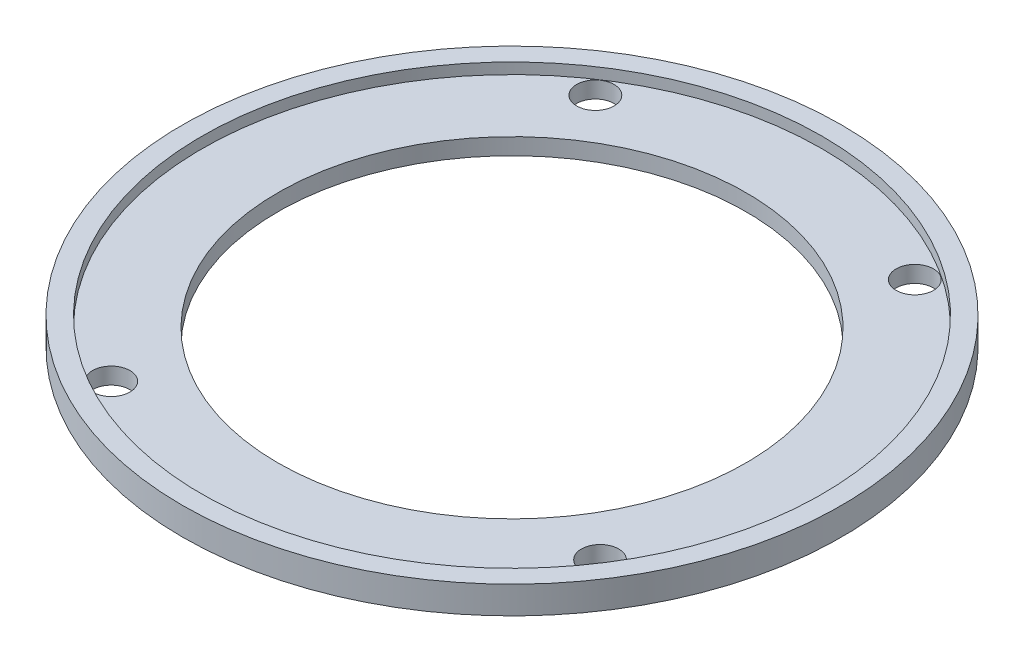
ISO-10303-21;
HEADER;
FILE_DESCRIPTION(('STEP AP214'),'2;1');
FILE_NAME('part.step','',(''),(''),'','','');
FILE_SCHEMA(('AUTOMOTIVE_DESIGN { 1 0 10303 214 1 1 1 1 }'));
ENDSEC;
DATA;
#1=APPLICATION_CONTEXT('core data for automotive mechanical design processes');
#2=APPLICATION_PROTOCOL_DEFINITION('international standard','automotive_design',2000,#1);
#3=PRODUCT_CONTEXT('',#1,'mechanical');
#4=PRODUCT('Part','Part','',(#3));
#5=PRODUCT_RELATED_PRODUCT_CATEGORY('part','',(#4));
#6=PRODUCT_DEFINITION_FORMATION('','',#4);
#7=PRODUCT_DEFINITION_CONTEXT('part definition',#1,'design');
#8=PRODUCT_DEFINITION('design','',#6,#7);
#9=PRODUCT_DEFINITION_SHAPE('','',#8);
#10=(LENGTH_UNIT() NAMED_UNIT(*) SI_UNIT(.MILLI.,.METRE.));
#11=(NAMED_UNIT(*) PLANE_ANGLE_UNIT() SI_UNIT($,.RADIAN.));
#12=(NAMED_UNIT(*) SI_UNIT($,.STERADIAN.) SOLID_ANGLE_UNIT());
#13=UNCERTAINTY_MEASURE_WITH_UNIT(LENGTH_MEASURE(1.E-05),#10,'distance_accuracy_value','');
#14=(GEOMETRIC_REPRESENTATION_CONTEXT(3) GLOBAL_UNCERTAINTY_ASSIGNED_CONTEXT((#13)) GLOBAL_UNIT_ASSIGNED_CONTEXT((#10,
#11,#12)) REPRESENTATION_CONTEXT('',''));
#15=CARTESIAN_POINT('',(0.,0.,0.));
#16=DIRECTION('',(0.,0.,1.));
#17=DIRECTION('',(1.,0.,0.));
#18=AXIS2_PLACEMENT_3D('',#15,#16,#17);
#19=CARTESIAN_POINT('',(0.,0.,0.));
#20=DIRECTION('',(0.,1.,0.));
#21=DIRECTION('',(0.,0.,1.));
#22=AXIS2_PLACEMENT_3D('',#19,#20,#21);
#23=PLANE('',#22);
#24=CARTESIAN_POINT('',(-15.2019,0.,-23.1390758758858));
#25=DIRECTION('',(0.,1.,0.));
#26=DIRECTION('',(0.,0.,1.));
#27=AXIS2_PLACEMENT_3D('',#24,#25,#26);
#28=CIRCLE('',#27,1.778);
#29=CARTESIAN_POINT('',(-15.2019,0.,-21.3610758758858));
#30=VERTEX_POINT('',#29);
#31=EDGE_CURVE('E70',#30,#30,#28,.T.);
#32=ORIENTED_EDGE('',*,*,#31,.T.);
#33=EDGE_LOOP('',(#32));
#34=FACE_BOUND('',#33,.T.);
#35=CARTESIAN_POINT('',(15.2019,0.,-23.1390758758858));
#36=DIRECTION('',(0.,1.,0.));
#37=DIRECTION('',(0.,0.,1.));
#38=AXIS2_PLACEMENT_3D('',#35,#36,#37);
#39=CIRCLE('',#38,1.778);
#40=CARTESIAN_POINT('',(15.2019,0.,-21.3610758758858));
#41=VERTEX_POINT('',#40);
#42=EDGE_CURVE('E64',#41,#41,#39,.T.);
#43=ORIENTED_EDGE('',*,*,#42,.T.);
#44=EDGE_LOOP('',(#43));
#45=FACE_BOUND('',#44,.T.);
#46=CARTESIAN_POINT('',(23.3143627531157,0.,14.9316805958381));
#47=DIRECTION('',(0.,1.,0.));
#48=DIRECTION('',(0.,0.,1.));
#49=AXIS2_PLACEMENT_3D('',#46,#47,#48);
#50=CIRCLE('',#49,1.778);
#51=CARTESIAN_POINT('',(23.3143627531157,0.,16.7096805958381));
#52=VERTEX_POINT('',#51);
#53=EDGE_CURVE('E58',#52,#52,#50,.T.);
#54=ORIENTED_EDGE('',*,*,#53,.T.);
#55=EDGE_LOOP('',(#54));
#56=FACE_BOUND('',#55,.T.);
#57=CARTESIAN_POINT('',(-14.6594402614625,0.,23.4864941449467));
#58=DIRECTION('',(0.,1.,0.));
#59=DIRECTION('',(0.,0.,1.));
#60=AXIS2_PLACEMENT_3D('',#57,#58,#59);
#61=CIRCLE('',#60,1.778);
#62=CARTESIAN_POINT('',(-14.6594402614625,0.,25.2644941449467));
#63=VERTEX_POINT('',#62);
#64=EDGE_CURVE('E52',#63,#63,#61,.T.);
#65=ORIENTED_EDGE('',*,*,#64,.T.);
#66=EDGE_LOOP('',(#65));
#67=FACE_BOUND('',#66,.T.);
#68=CARTESIAN_POINT('',(0.,0.,0.));
#69=DIRECTION('',(0.,1.,0.));
#70=DIRECTION('',(0.,0.,1.));
#71=AXIS2_PLACEMENT_3D('',#68,#69,#70);
#72=CIRCLE('',#71,22.28215);
#73=CARTESIAN_POINT('',(0.,0.,22.28215));
#74=VERTEX_POINT('',#73);
#75=EDGE_CURVE('E43',#74,#74,#72,.T.);
#76=ORIENTED_EDGE('',*,*,#75,.T.);
#77=EDGE_LOOP('',(#76));
#78=FACE_BOUND('',#77,.T.);
#79=CARTESIAN_POINT('',(0.,0.,0.));
#80=DIRECTION('',(0.,-1.,0.));
#81=DIRECTION('',(0.,0.,-1.));
#82=AXIS2_PLACEMENT_3D('',#79,#80,#81);
#83=CIRCLE('',#82,31.369);
#84=CARTESIAN_POINT('',(0.,0.,-31.369));
#85=VERTEX_POINT('',#84);
#86=EDGE_CURVE('E48',#85,#85,#83,.T.);
#87=ORIENTED_EDGE('',*,*,#86,.T.);
#88=EDGE_LOOP('',(#87));
#89=FACE_BOUND('',#88,.T.);
#90=ADVANCED_FACE('F33',(#34,#45,#56,#67,#78,#89),#23,.F.);
#91=CARTESIAN_POINT('',(0.,1.5748,0.));
#92=DIRECTION('',(0.,1.,0.));
#93=DIRECTION('',(0.,0.,1.));
#94=AXIS2_PLACEMENT_3D('',#91,#92,#93);
#95=PLANE('',#94);
#96=CARTESIAN_POINT('',(0.,1.5748,0.));
#97=DIRECTION('',(0.,1.,0.));
#98=DIRECTION('',(0.,0.,1.));
#99=AXIS2_PLACEMENT_3D('',#96,#97,#98);
#100=CIRCLE('',#99,29.5148);
#101=CARTESIAN_POINT('',(0.,1.57479999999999,-29.5148));
#102=VERTEX_POINT('',#101);
#103=EDGE_CURVE('E11',#102,#102,#100,.F.);
#104=ORIENTED_EDGE('',*,*,#103,.F.);
#105=EDGE_LOOP('',(#104));
#106=FACE_BOUND('',#105,.T.);
#107=CARTESIAN_POINT('',(-15.2019,1.5748,-23.1390758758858));
#108=DIRECTION('',(0.,-1.,0.));
#109=DIRECTION('',(0.,0.,-1.));
#110=AXIS2_PLACEMENT_3D('',#107,#108,#109);
#111=CIRCLE('',#110,1.778);
#112=CARTESIAN_POINT('',(-15.2019,1.5748,-24.9170758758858));
#113=VERTEX_POINT('',#112);
#114=EDGE_CURVE('E73',#113,#113,#111,.T.);
#115=ORIENTED_EDGE('',*,*,#114,.T.);
#116=EDGE_LOOP('',(#115));
#117=FACE_BOUND('',#116,.T.);
#118=CARTESIAN_POINT('',(15.2019,1.5748,-23.1390758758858));
#119=DIRECTION('',(0.,-1.,0.));
#120=DIRECTION('',(0.,0.,-1.));
#121=AXIS2_PLACEMENT_3D('',#118,#119,#120);
#122=CIRCLE('',#121,1.778);
#123=CARTESIAN_POINT('',(15.2019,1.5748,-24.9170758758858));
#124=VERTEX_POINT('',#123);
#125=EDGE_CURVE('E67',#124,#124,#122,.T.);
#126=ORIENTED_EDGE('',*,*,#125,.T.);
#127=EDGE_LOOP('',(#126));
#128=FACE_BOUND('',#127,.T.);
#129=CARTESIAN_POINT('',(23.3143627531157,1.5748,14.9316805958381));
#130=DIRECTION('',(0.,-1.,0.));
#131=DIRECTION('',(0.,0.,-1.));
#132=AXIS2_PLACEMENT_3D('',#129,#130,#131);
#133=CIRCLE('',#132,1.778);
#134=CARTESIAN_POINT('',(23.3143627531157,1.5748,13.1536805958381));
#135=VERTEX_POINT('',#134);
#136=EDGE_CURVE('E61',#135,#135,#133,.T.);
#137=ORIENTED_EDGE('',*,*,#136,.T.);
#138=EDGE_LOOP('',(#137));
#139=FACE_BOUND('',#138,.T.);
#140=CARTESIAN_POINT('',(-14.6594402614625,1.5748,23.4864941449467));
#141=DIRECTION('',(0.,-1.,0.));
#142=DIRECTION('',(0.,0.,-1.));
#143=AXIS2_PLACEMENT_3D('',#140,#141,#142);
#144=CIRCLE('',#143,1.778);
#145=CARTESIAN_POINT('',(-14.6594402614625,1.5748,21.7084941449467));
#146=VERTEX_POINT('',#145);
#147=EDGE_CURVE('E55',#146,#146,#144,.T.);
#148=ORIENTED_EDGE('',*,*,#147,.T.);
#149=EDGE_LOOP('',(#148));
#150=FACE_BOUND('',#149,.T.);
#151=CARTESIAN_POINT('',(0.,1.5748,0.));
#152=DIRECTION('',(0.,1.,0.));
#153=DIRECTION('',(0.,0.,1.));
#154=AXIS2_PLACEMENT_3D('',#151,#152,#153);
#155=CIRCLE('',#154,22.28215);
#156=CARTESIAN_POINT('',(0.,1.5748,22.28215));
#157=VERTEX_POINT('',#156);
#158=EDGE_CURVE('E39',#157,#157,#155,.T.);
#159=ORIENTED_EDGE('',*,*,#158,.F.);
#160=EDGE_LOOP('',(#159));
#161=FACE_BOUND('',#160,.T.);
#162=ADVANCED_FACE('F98',(#106,#117,#128,#139,#150,#161),#95,.T.);
#163=CARTESIAN_POINT('',(0.,1.5748,0.));
#164=DIRECTION('',(0.,-1.,0.));
#165=DIRECTION('',(0.,0.,-1.));
#166=AXIS2_PLACEMENT_3D('',#163,#164,#165);
#167=CYLINDRICAL_SURFACE('',#166,22.28215);
#168=ORIENTED_EDGE('',*,*,#158,.T.);
#169=EDGE_LOOP('',(#168));
#170=FACE_BOUND('',#169,.T.);
#171=ORIENTED_EDGE('',*,*,#75,.F.);
#172=EDGE_LOOP('',(#171));
#173=FACE_BOUND('',#172,.T.);
#174=ADVANCED_FACE('F88',(#170,#173),#167,.F.);
#175=CARTESIAN_POINT('',(0.,90.2997304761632,0.));
#176=DIRECTION('',(0.,-1.,0.));
#177=DIRECTION('',(0.,0.,-1.));
#178=AXIS2_PLACEMENT_3D('',#175,#176,#177);
#179=CYLINDRICAL_SURFACE('',#178,31.369);
#180=ORIENTED_EDGE('',*,*,#86,.F.);
#181=EDGE_LOOP('',(#180));
#182=FACE_BOUND('',#181,.T.);
#183=CARTESIAN_POINT('',(0.,2.6162,0.));
#184=DIRECTION('',(0.,1.,0.));
#185=DIRECTION('',(0.,0.,1.));
#186=AXIS2_PLACEMENT_3D('',#183,#184,#185);
#187=CIRCLE('',#186,31.369);
#188=CARTESIAN_POINT('',(0.,2.6162,31.369));
#189=VERTEX_POINT('',#188);
#190=EDGE_CURVE('E76',#189,#189,#187,.T.);
#191=ORIENTED_EDGE('',*,*,#190,.F.);
#192=EDGE_LOOP('',(#191));
#193=FACE_BOUND('',#192,.T.);
#194=ADVANCED_FACE('F85',(#182,#193),#179,.T.);
#195=CARTESIAN_POINT('',(-14.6594402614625,1.5748,23.4864941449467));
#196=DIRECTION('',(0.,-1.,0.));
#197=DIRECTION('',(0.,0.,-1.));
#198=AXIS2_PLACEMENT_3D('',#195,#196,#197);
#199=CYLINDRICAL_SURFACE('',#198,1.778);
#200=ORIENTED_EDGE('',*,*,#147,.F.);
#201=EDGE_LOOP('',(#200));
#202=FACE_BOUND('',#201,.T.);
#203=ORIENTED_EDGE('',*,*,#64,.F.);
#204=EDGE_LOOP('',(#203));
#205=FACE_BOUND('',#204,.T.);
#206=ADVANCED_FACE('F87',(#202,#205),#199,.F.);
#207=CARTESIAN_POINT('',(23.3143627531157,1.5748,14.9316805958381));
#208=DIRECTION('',(0.,-1.,0.));
#209=DIRECTION('',(0.,0.,-1.));
#210=AXIS2_PLACEMENT_3D('',#207,#208,#209);
#211=CYLINDRICAL_SURFACE('',#210,1.778);
#212=ORIENTED_EDGE('',*,*,#136,.F.);
#213=EDGE_LOOP('',(#212));
#214=FACE_BOUND('',#213,.T.);
#215=ORIENTED_EDGE('',*,*,#53,.F.);
#216=EDGE_LOOP('',(#215));
#217=FACE_BOUND('',#216,.T.);
#218=ADVANCED_FACE('F95',(#214,#217),#211,.F.);
#219=CARTESIAN_POINT('',(15.2019,1.5748,-23.1390758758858));
#220=DIRECTION('',(0.,-1.,0.));
#221=DIRECTION('',(0.,0.,-1.));
#222=AXIS2_PLACEMENT_3D('',#219,#220,#221);
#223=CYLINDRICAL_SURFACE('',#222,1.778);
#224=ORIENTED_EDGE('',*,*,#125,.F.);
#225=EDGE_LOOP('',(#224));
#226=FACE_BOUND('',#225,.T.);
#227=ORIENTED_EDGE('',*,*,#42,.F.);
#228=EDGE_LOOP('',(#227));
#229=FACE_BOUND('',#228,.T.);
#230=ADVANCED_FACE('F121',(#226,#229),#223,.F.);
#231=CARTESIAN_POINT('',(-15.2019,1.5748,-23.1390758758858));
#232=DIRECTION('',(0.,-1.,0.));
#233=DIRECTION('',(0.,0.,-1.));
#234=AXIS2_PLACEMENT_3D('',#231,#232,#233);
#235=CYLINDRICAL_SURFACE('',#234,1.778);
#236=ORIENTED_EDGE('',*,*,#114,.F.);
#237=EDGE_LOOP('',(#236));
#238=FACE_BOUND('',#237,.T.);
#239=ORIENTED_EDGE('',*,*,#31,.F.);
#240=EDGE_LOOP('',(#239));
#241=FACE_BOUND('',#240,.T.);
#242=ADVANCED_FACE('F127',(#238,#241),#235,.F.);
#243=CARTESIAN_POINT('',(0.,93.9573304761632,0.));
#244=DIRECTION('',(0.,-1.,0.));
#245=DIRECTION('',(0.,0.,-1.));
#246=AXIS2_PLACEMENT_3D('',#243,#244,#245);
#247=CYLINDRICAL_SURFACE('',#246,29.5148);
#248=CARTESIAN_POINT('',(0.,2.6162,0.));
#249=DIRECTION('',(0.,1.,0.));
#250=DIRECTION('',(0.,0.,1.));
#251=AXIS2_PLACEMENT_3D('',#248,#249,#250);
#252=CIRCLE('',#251,29.5148);
#253=CARTESIAN_POINT('',(0.,2.61619999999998,-29.5148));
#254=VERTEX_POINT('',#253);
#255=EDGE_CURVE('E77',#254,#254,#252,.T.);
#256=CARTESIAN_POINT('',(0.,1.57479999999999,-29.5148));
#257=CARTESIAN_POINT('',(0.,1.58564791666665,-29.5148));
#258=CARTESIAN_POINT('',(0.,1.59649583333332,-29.5148));
#259=CARTESIAN_POINT('',(0.,1.61819166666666,-29.5148));
#260=CARTESIAN_POINT('',(0.,1.62903958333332,-29.5148));
#261=CARTESIAN_POINT('',(0.,1.65073541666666,-29.5148));
#262=CARTESIAN_POINT('',(0.,1.66158333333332,-29.5148));
#263=CARTESIAN_POINT('',(0.,1.68327916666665,-29.5148));
#264=CARTESIAN_POINT('',(0.,1.69412708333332,-29.5148));
#265=CARTESIAN_POINT('',(0.,1.71582291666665,-29.5148));
#266=CARTESIAN_POINT('',(0.,1.72667083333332,-29.5148));
#267=CARTESIAN_POINT('',(0.,1.74836666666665,-29.5148));
#268=CARTESIAN_POINT('',(0.,1.75921458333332,-29.5148));
#269=CARTESIAN_POINT('',(0.,1.78091041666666,-29.5148));
#270=CARTESIAN_POINT('',(0.,1.79175833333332,-29.5148));
#271=CARTESIAN_POINT('',(0.,1.81345416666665,-29.5148));
#272=CARTESIAN_POINT('',(0.,1.82430208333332,-29.5148));
#273=CARTESIAN_POINT('',(0.,1.84599791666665,-29.5148));
#274=CARTESIAN_POINT('',(0.,1.85684583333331,-29.5148));
#275=CARTESIAN_POINT('',(0.,1.87854166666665,-29.5148));
#276=CARTESIAN_POINT('',(0.,1.88938958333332,-29.5148));
#277=CARTESIAN_POINT('',(0.,1.91108541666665,-29.5148));
#278=CARTESIAN_POINT('',(0.,1.92193333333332,-29.5148));
#279=CARTESIAN_POINT('',(0.,1.94362916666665,-29.5148));
#280=CARTESIAN_POINT('',(0.,1.95447708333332,-29.5148));
#281=CARTESIAN_POINT('',(0.,1.97617291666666,-29.5148));
#282=CARTESIAN_POINT('',(0.,1.98702083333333,-29.5148));
#283=CARTESIAN_POINT('',(0.,2.00871666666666,-29.5148));
#284=CARTESIAN_POINT('',(0.,2.01956458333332,-29.5148));
#285=CARTESIAN_POINT('',(0.,2.04126041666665,-29.5148));
#286=CARTESIAN_POINT('',(0.,2.05210833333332,-29.5148));
#287=CARTESIAN_POINT('',(0.,2.07380416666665,-29.5148));
#288=CARTESIAN_POINT('',(0.,2.08465208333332,-29.5148));
#289=CARTESIAN_POINT('',(0.,2.10634791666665,-29.5148));
#290=CARTESIAN_POINT('',(0.,2.11719583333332,-29.5148));
#291=CARTESIAN_POINT('',(0.,2.13889166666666,-29.5148));
#292=CARTESIAN_POINT('',(0.,2.14973958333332,-29.5148));
#293=CARTESIAN_POINT('',(0.,2.17143541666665,-29.5148));
#294=CARTESIAN_POINT('',(0.,2.18228333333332,-29.5148));
#295=CARTESIAN_POINT('',(0.,2.20397916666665,-29.5148));
#296=CARTESIAN_POINT('',(0.,2.21482708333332,-29.5148));
#297=CARTESIAN_POINT('',(0.,2.23652291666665,-29.5148));
#298=CARTESIAN_POINT('',(0.,2.24737083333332,-29.5148));
#299=CARTESIAN_POINT('',(0.,2.26906666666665,-29.5148));
#300=CARTESIAN_POINT('',(0.,2.27991458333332,-29.5148));
#301=CARTESIAN_POINT('',(0.,2.30161041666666,-29.5148));
#302=CARTESIAN_POINT('',(0.,2.31245833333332,-29.5148));
#303=CARTESIAN_POINT('',(0.,2.33415416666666,-29.5148));
#304=CARTESIAN_POINT('',(0.,2.34500208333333,-29.5148));
#305=CARTESIAN_POINT('',(0.,2.36669791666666,-29.5148));
#306=CARTESIAN_POINT('',(0.,2.37754583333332,-29.5148));
#307=CARTESIAN_POINT('',(0.,2.39924166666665,-29.5148));
#308=CARTESIAN_POINT('',(0.,2.41008958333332,-29.5148));
#309=CARTESIAN_POINT('',(0.,2.43178541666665,-29.5148));
#310=CARTESIAN_POINT('',(0.,2.44263333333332,-29.5148));
#311=CARTESIAN_POINT('',(0.,2.46432916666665,-29.5148));
#312=CARTESIAN_POINT('',(0.,2.47517708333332,-29.5148));
#313=CARTESIAN_POINT('',(0.,2.49687291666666,-29.5148));
#314=CARTESIAN_POINT('',(0.,2.50772083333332,-29.5148));
#315=CARTESIAN_POINT('',(0.,2.52941666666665,-29.5148));
#316=CARTESIAN_POINT('',(0.,2.54026458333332,-29.5148));
#317=CARTESIAN_POINT('',(0.,2.56196041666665,-29.5148));
#318=CARTESIAN_POINT('',(0.,2.57280833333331,-29.5148));
#319=CARTESIAN_POINT('',(0.,2.59450416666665,-29.5148));
#320=CARTESIAN_POINT('',(0.,2.60535208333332,-29.5148));
#321=CARTESIAN_POINT('',(0.,2.61619999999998,-29.5148));
#322=B_SPLINE_CURVE_WITH_KNOTS('',3,(#256,#257,#258,#259,#260,#261,#262,#263,#264,#265,#266,
#267,#268,#269,#270,#271,#272,#273,#274,#275,#276,#277,#278,#279,#280,#281,#282,#283,#284,#285,
#286,#287,#288,#289,#290,#291,#292,#293,#294,#295,#296,#297,#298,#299,#300,#301,#302,#303,#304,
#305,#306,#307,#308,#309,#310,#311,#312,#313,#314,#315,#316,#317,#318,#319,#320,#321),
.UNSPECIFIED.,.F.,.F.,(4,2,2,2,2,2,2,2,2,2,2,2,2,2,2,2,2,2,2,2,2,2,2,2,2,2,2,2,2,2,2,2,4),(0.,
0.0325437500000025,0.0650875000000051,0.0976312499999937,0.130174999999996,0.162718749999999,
0.195262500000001,0.227806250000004,0.260349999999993,0.292893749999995,0.325437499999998,
0.35798125,0.390525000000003,0.423068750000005,0.455612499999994,0.488156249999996,
0.520699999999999,0.553243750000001,0.585787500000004,0.618331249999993,0.650874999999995,
0.683418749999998,0.7159625,0.748506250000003,0.781050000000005,0.813593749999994,
0.846137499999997,0.878681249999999,0.911225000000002,0.943768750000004,0.976312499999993,
1.00885625,1.0414),.UNSPECIFIED.);
#323=EDGE_CURVE('BSEAM134',#102,#254,#322,.T.);
#324=ORIENTED_EDGE('',*,*,#103,.T.);
#325=ORIENTED_EDGE('',*,*,#255,.T.);
#326=ORIENTED_EDGE('',*,*,#323,.T.);
#327=ORIENTED_EDGE('',*,*,#323,.F.);
#328=EDGE_LOOP('',(#324,#326,#325,#327));
#329=FACE_BOUND('',#328,.T.);
#330=ADVANCED_FACE('F134',(#329),#247,.F.);
#331=CARTESIAN_POINT('',(0.,2.6162,0.));
#332=DIRECTION('',(0.,1.,0.));
#333=DIRECTION('',(0.,0.,1.));
#334=AXIS2_PLACEMENT_3D('',#331,#332,#333);
#335=PLANE('',#334);
#336=ORIENTED_EDGE('',*,*,#255,.F.);
#337=EDGE_LOOP('',(#336));
#338=FACE_BOUND('',#337,.T.);
#339=ORIENTED_EDGE('',*,*,#190,.T.);
#340=EDGE_LOOP('',(#339));
#341=FACE_BOUND('',#340,.T.);
#342=ADVANCED_FACE('F83',(#338,#341),#335,.T.);
#343=CLOSED_SHELL('',(#90,#162,#174,#194,#206,#218,#230,#242,#330,#342));
#344=MANIFOLD_SOLID_BREP('B2',#343);
#345=ADVANCED_BREP_SHAPE_REPRESENTATION('',(#18,#344),#14);
#346=SHAPE_DEFINITION_REPRESENTATION(#9,#345);
ENDSEC;
END-ISO-10303-21;
